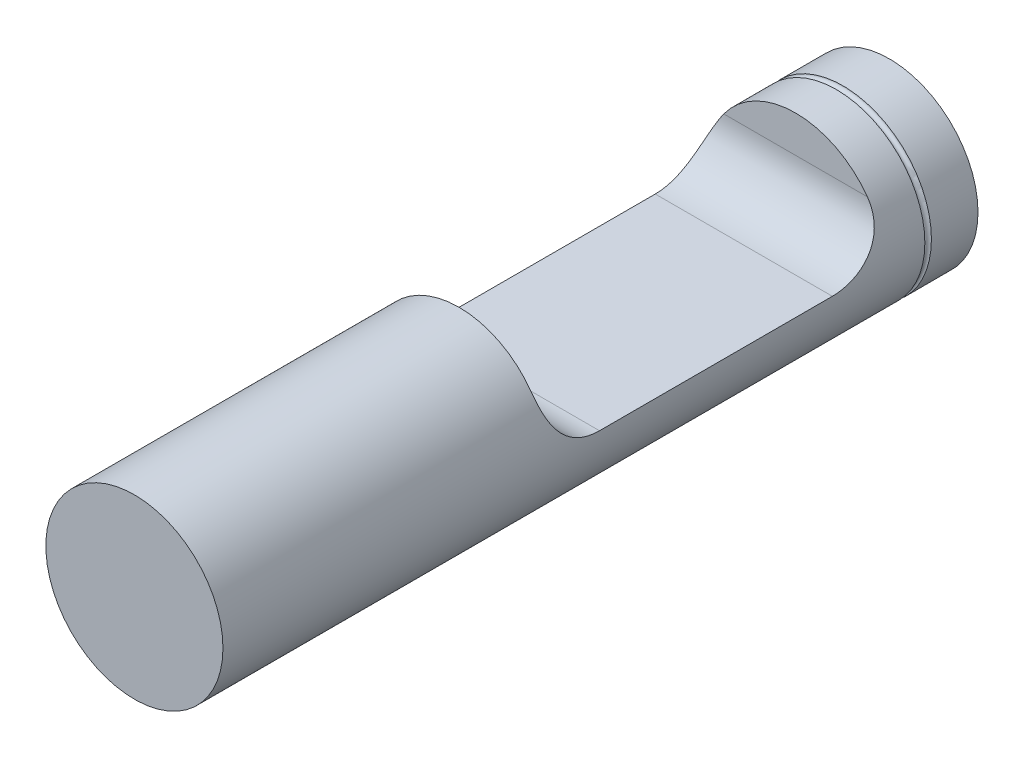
ISO-10303-21;
HEADER;
FILE_DESCRIPTION(('STEP AP214'),'2;1');
FILE_NAME('part.step','',(''),(''),'','','');
FILE_SCHEMA(('AUTOMOTIVE_DESIGN { 1 0 10303 214 1 1 1 1 }'));
ENDSEC;
DATA;
#1=APPLICATION_CONTEXT('core data for automotive mechanical design processes');
#2=APPLICATION_PROTOCOL_DEFINITION('international standard','automotive_design',2000,#1);
#3=PRODUCT_CONTEXT('',#1,'mechanical');
#4=PRODUCT('Part','Part','',(#3));
#5=PRODUCT_RELATED_PRODUCT_CATEGORY('part','',(#4));
#6=PRODUCT_DEFINITION_FORMATION('','',#4);
#7=PRODUCT_DEFINITION_CONTEXT('part definition',#1,'design');
#8=PRODUCT_DEFINITION('design','',#6,#7);
#9=PRODUCT_DEFINITION_SHAPE('','',#8);
#10=(LENGTH_UNIT() NAMED_UNIT(*) SI_UNIT(.MILLI.,.METRE.));
#11=(NAMED_UNIT(*) PLANE_ANGLE_UNIT() SI_UNIT($,.RADIAN.));
#12=(NAMED_UNIT(*) SI_UNIT($,.STERADIAN.) SOLID_ANGLE_UNIT());
#13=UNCERTAINTY_MEASURE_WITH_UNIT(LENGTH_MEASURE(1.E-05),#10,'distance_accuracy_value','');
#14=(GEOMETRIC_REPRESENTATION_CONTEXT(3) GLOBAL_UNCERTAINTY_ASSIGNED_CONTEXT((#13)) GLOBAL_UNIT_ASSIGNED_CONTEXT((#10,
#11,#12)) REPRESENTATION_CONTEXT('',''));
#15=CARTESIAN_POINT('',(0.,0.,0.));
#16=DIRECTION('',(0.,0.,1.));
#17=DIRECTION('',(1.,0.,0.));
#18=AXIS2_PLACEMENT_3D('',#15,#16,#17);
#19=CARTESIAN_POINT('',(0.,0.,-11.51));
#20=DIRECTION('',(0.,0.,1.));
#21=DIRECTION('',(1.,0.,0.));
#22=AXIS2_PLACEMENT_3D('',#19,#20,#21);
#23=CYLINDRICAL_SURFACE('',#22,1.35);
#24=CARTESIAN_POINT('',(0.,0.,-4.95));
#25=DIRECTION('',(0.,0.,-1.));
#26=DIRECTION('',(-1.,0.,0.));
#27=AXIS2_PLACEMENT_3D('',#24,#25,#26);
#28=CIRCLE('',#27,1.35);
#29=CARTESIAN_POINT('',(-1.09471457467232,0.79,-4.95));
#30=VERTEX_POINT('',#29);
#31=CARTESIAN_POINT('',(1.09471457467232,0.79,-4.95));
#32=VERTEX_POINT('',#31);
#33=EDGE_CURVE('E104',#30,#32,#28,.T.);
#34=ORIENTED_EDGE('',*,*,#33,.F.);
#35=CARTESIAN_POINT('',(-1.09471457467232,0.79,-4.95));
#36=CARTESIAN_POINT('',(-1.10753067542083,0.772242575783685,-4.95000059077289));
#37=CARTESIAN_POINT('',(-1.11990981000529,0.754174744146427,-4.95059953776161));
#38=CARTESIAN_POINT('',(-1.14374632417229,0.71751167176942,-4.95311743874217));
#39=CARTESIAN_POINT('',(-1.15520298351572,0.698916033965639,-4.95503741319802));
#40=CARTESIAN_POINT('',(-1.18811575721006,0.642473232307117,-4.96296940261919));
#41=CARTESIAN_POINT('',(-1.2080825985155,0.604014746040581,-4.97115409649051));
#42=CARTESIAN_POINT('',(-1.24371033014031,0.526786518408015,-4.99404541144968));
#43=CARTESIAN_POINT('',(-1.25934948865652,0.488016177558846,-5.00878401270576));
#44=CARTESIAN_POINT('',(-1.28616882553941,0.412170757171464,-5.04494314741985));
#45=CARTESIAN_POINT('',(-1.29735817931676,0.375092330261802,-5.06634976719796));
#46=CARTESIAN_POINT('',(-1.31505660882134,0.307033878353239,-5.11356050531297));
#47=CARTESIAN_POINT('',(-1.32186040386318,0.275804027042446,-5.13889732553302));
#48=CARTESIAN_POINT('',(-1.33272700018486,0.217314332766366,-5.19432967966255));
#49=CARTESIAN_POINT('',(-1.33678772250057,0.190057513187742,-5.22442880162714));
#50=CARTESIAN_POINT('',(-1.34295906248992,0.140029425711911,-5.28907353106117));
#51=CARTESIAN_POINT('',(-1.34503853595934,0.117334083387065,-5.32368072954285));
#52=CARTESIAN_POINT('',(-1.3479148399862,0.077607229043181,-5.39604798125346));
#53=CARTESIAN_POINT('',(-1.34871135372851,0.0605771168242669,-5.43380881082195));
#54=CARTESIAN_POINT('',(-1.34972781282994,0.0312310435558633,-5.51543588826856));
#55=CARTESIAN_POINT('',(-1.34988252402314,0.0195525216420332,-5.55953582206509));
#56=CARTESIAN_POINT('',(-1.34998211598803,0.00783927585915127,-5.62666754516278));
#57=CARTESIAN_POINT('',(-1.34999318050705,0.00490226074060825,-5.64923074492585));
#58=CARTESIAN_POINT('',(-1.35000040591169,0.000982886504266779,-5.69452524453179));
#59=CARTESIAN_POINT('',(-1.34999656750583,4.34465088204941E-07,-5.71725653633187));
#60=CARTESIAN_POINT('',(-1.35,0.,-5.74));
#61=B_SPLINE_CURVE_WITH_KNOTS('',3,(#35,#36,#37,#38,#39,#40,#41,#42,#43,#44,#45,#46,#47,#48,#49,
#50,#51,#52,#53,#54,#55,#56,#57,#58,#59,#60),.UNSPECIFIED.,.F.,.F.,(4,2,2,2,2,2,2,2,2,2,2,2,4),
(0.,0.065671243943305,0.131393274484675,0.263000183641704,0.395256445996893,0.527238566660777,
0.649027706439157,0.770909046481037,0.894676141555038,1.01847379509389,1.15458593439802,
1.222774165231,1.29095915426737),.UNSPECIFIED.);
#62=CARTESIAN_POINT('',(-1.35,0.,-5.74));
#63=VERTEX_POINT('',#62);
#64=EDGE_CURVE('E11',#30,#63,#61,.T.);
#65=ORIENTED_EDGE('',*,*,#64,.T.);
#66=DIRECTION('',(0.,0.,1.));
#67=VECTOR('',#66,1.);
#68=CARTESIAN_POINT('',(-1.35,0.,-11.51));
#69=LINE('',#68,#67);
#70=CARTESIAN_POINT('',(-1.35,0.,-9.29));
#71=VERTEX_POINT('',#70);
#72=EDGE_CURVE('E92',#71,#63,#69,.T.);
#73=ORIENTED_EDGE('',*,*,#72,.F.);
#74=CARTESIAN_POINT('',(-1.35,0.,-9.29));
#75=CARTESIAN_POINT('',(-1.34999688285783,1.57990570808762E-07,-9.31215081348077));
#76=CARTESIAN_POINT('',(-1.35000035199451,0.000932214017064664,-9.33429103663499));
#77=CARTESIAN_POINT('',(-1.34999387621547,0.00465066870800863,-9.37841442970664));
#78=CARTESIAN_POINT('',(-1.34998393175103,0.00743700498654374,-9.40039760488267));
#79=CARTESIAN_POINT('',(-1.34989416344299,0.0185557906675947,-9.46586549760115));
#80=CARTESIAN_POINT('',(-1.34975450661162,0.0296480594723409,-9.50891427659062));
#81=CARTESIAN_POINT('',(-1.34879362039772,0.0588844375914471,-9.59254971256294));
#82=CARTESIAN_POINT('',(-1.34797193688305,0.0770332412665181,-9.63313470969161));
#83=CARTESIAN_POINT('',(-1.34484045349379,0.119845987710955,-9.71065644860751));
#84=CARTESIAN_POINT('',(-1.34253089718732,0.144508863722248,-9.74759378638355));
#85=CARTESIAN_POINT('',(-1.33550886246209,0.199152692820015,-9.81620885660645));
#86=CARTESIAN_POINT('',(-1.33083031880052,0.229054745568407,-9.84795271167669));
#87=CARTESIAN_POINT('',(-1.3181688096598,0.293251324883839,-9.90579494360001));
#88=CARTESIAN_POINT('',(-1.31018959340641,0.327540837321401,-9.93189967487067));
#89=CARTESIAN_POINT('',(-1.29075735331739,0.397082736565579,-9.97653417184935));
#90=CARTESIAN_POINT('',(-1.27951885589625,0.432179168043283,-9.9954008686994));
#91=CARTESIAN_POINT('',(-1.25313278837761,0.503596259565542,-10.0272961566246));
#92=CARTESIAN_POINT('',(-1.23797916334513,0.539918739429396,-10.0403156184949));
#93=CARTESIAN_POINT('',(-1.20356311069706,0.612848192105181,-10.0608261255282));
#94=CARTESIAN_POINT('',(-1.1842449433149,0.649451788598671,-10.0682353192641));
#95=CARTESIAN_POINT('',(-1.15258684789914,0.703191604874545,-10.075424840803));
#96=CARTESIAN_POINT('',(-1.14159448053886,0.720900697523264,-10.0771674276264));
#97=CARTESIAN_POINT('',(-1.11877173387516,0.755833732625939,-10.0794543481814));
#98=CARTESIAN_POINT('',(-1.10694193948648,0.773058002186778,-10.0799995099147));
#99=CARTESIAN_POINT('',(-1.09471457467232,0.79,-10.08));
#100=B_SPLINE_CURVE_WITH_KNOTS('',3,(#74,#75,#76,#77,#78,#79,#80,#81,#82,#83,#84,#85,#86,#87,
#88,#89,#90,#91,#92,#93,#94,#95,#96,#97,#98,#99),.UNSPECIFIED.,.F.,.F.,(4,2,2,2,2,2,2,2,2,2,2,2,
4),(0.,0.0664117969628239,0.132821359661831,0.265505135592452,0.398277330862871,
0.531027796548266,0.661928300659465,0.792680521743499,0.916261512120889,1.04003478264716,
1.16558079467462,1.22828123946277,1.29093831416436),.UNSPECIFIED.);
#101=CARTESIAN_POINT('',(-1.09471457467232,0.79,-10.08));
#102=VERTEX_POINT('',#101);
#103=EDGE_CURVE('E76',#71,#102,#100,.T.);
#104=ORIENTED_EDGE('',*,*,#103,.T.);
#105=CARTESIAN_POINT('',(0.,0.,-10.08));
#106=DIRECTION('',(0.,0.,1.));
#107=DIRECTION('',(1.,0.,0.));
#108=AXIS2_PLACEMENT_3D('',#105,#106,#107);
#109=CIRCLE('',#108,1.35);
#110=CARTESIAN_POINT('',(1.09471457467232,0.79,-10.08));
#111=VERTEX_POINT('',#110);
#112=EDGE_CURVE('E146',#111,#102,#109,.T.);
#113=ORIENTED_EDGE('',*,*,#112,.F.);
#114=CARTESIAN_POINT('',(1.09471457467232,0.79,-10.08));
#115=CARTESIAN_POINT('',(1.10753067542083,0.772242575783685,-10.0799994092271));
#116=CARTESIAN_POINT('',(1.11990981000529,0.754174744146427,-10.0794004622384));
#117=CARTESIAN_POINT('',(1.14374632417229,0.71751167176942,-10.0768825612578));
#118=CARTESIAN_POINT('',(1.15520298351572,0.698916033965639,-10.074962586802));
#119=CARTESIAN_POINT('',(1.18811575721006,0.642473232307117,-10.0670305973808));
#120=CARTESIAN_POINT('',(1.2080825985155,0.604014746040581,-10.0588459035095));
#121=CARTESIAN_POINT('',(1.24371033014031,0.526786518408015,-10.0359545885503));
#122=CARTESIAN_POINT('',(1.25934948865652,0.488016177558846,-10.0212159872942));
#123=CARTESIAN_POINT('',(1.28616882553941,0.412170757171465,-9.98505685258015));
#124=CARTESIAN_POINT('',(1.29735817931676,0.375092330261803,-9.96365023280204));
#125=CARTESIAN_POINT('',(1.31505660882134,0.30703387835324,-9.91643949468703));
#126=CARTESIAN_POINT('',(1.32186040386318,0.275804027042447,-9.89110267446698));
#127=CARTESIAN_POINT('',(1.33272700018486,0.217314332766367,-9.83567032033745));
#128=CARTESIAN_POINT('',(1.33678772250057,0.190057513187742,-9.80557119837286));
#129=CARTESIAN_POINT('',(1.34295906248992,0.140029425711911,-9.74092646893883));
#130=CARTESIAN_POINT('',(1.34503853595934,0.117334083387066,-9.70631927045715));
#131=CARTESIAN_POINT('',(1.3479148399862,0.0776072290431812,-9.63395201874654));
#132=CARTESIAN_POINT('',(1.34871135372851,0.0605771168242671,-9.59619118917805));
#133=CARTESIAN_POINT('',(1.34972781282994,0.0312310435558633,-9.51456411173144));
#134=CARTESIAN_POINT('',(1.34988252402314,0.0195525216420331,-9.47046417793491));
#135=CARTESIAN_POINT('',(1.34998211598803,0.00783927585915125,-9.40333245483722));
#136=CARTESIAN_POINT('',(1.34999318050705,0.00490226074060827,-9.38076925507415));
#137=CARTESIAN_POINT('',(1.35000040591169,0.00098288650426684,-9.33547475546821));
#138=CARTESIAN_POINT('',(1.34999656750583,4.34465088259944E-07,-9.31274346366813));
#139=CARTESIAN_POINT('',(1.35,0.,-9.29));
#140=B_SPLINE_CURVE_WITH_KNOTS('',3,(#114,#115,#116,#117,#118,#119,#120,#121,#122,#123,#124,
#125,#126,#127,#128,#129,#130,#131,#132,#133,#134,#135,#136,#137,#138,#139),.UNSPECIFIED.,.F.,
.F.,(4,2,2,2,2,2,2,2,2,2,2,2,4),(0.,0.0656712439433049,0.131393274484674,0.263000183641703,
0.395256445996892,0.527238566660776,0.649027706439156,0.770909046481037,0.894676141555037,
1.01847379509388,1.15458593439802,1.222774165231,1.29095915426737),.UNSPECIFIED.);
#141=CARTESIAN_POINT('',(1.35,0.,-9.29));
#142=VERTEX_POINT('',#141);
#143=EDGE_CURVE('E85',#111,#142,#140,.T.);
#144=ORIENTED_EDGE('',*,*,#143,.T.);
#145=DIRECTION('',(0.,0.,1.));
#146=VECTOR('',#145,1.);
#147=CARTESIAN_POINT('',(1.35,0.,-11.51));
#148=LINE('',#147,#146);
#149=CARTESIAN_POINT('',(1.35,0.,-5.74));
#150=VERTEX_POINT('',#149);
#151=EDGE_CURVE('E94',#150,#142,#148,.F.);
#152=ORIENTED_EDGE('',*,*,#151,.F.);
#153=CARTESIAN_POINT('',(1.35,0.,-5.74));
#154=CARTESIAN_POINT('',(1.34999688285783,1.57990570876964E-07,-5.71784918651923));
#155=CARTESIAN_POINT('',(1.35000035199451,0.000932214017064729,-5.69570896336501));
#156=CARTESIAN_POINT('',(1.34999387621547,0.00465066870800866,-5.65158557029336));
#157=CARTESIAN_POINT('',(1.34998393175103,0.00743700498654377,-5.62960239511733));
#158=CARTESIAN_POINT('',(1.34989416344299,0.0185557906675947,-5.56413450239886));
#159=CARTESIAN_POINT('',(1.34975450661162,0.0296480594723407,-5.52108572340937));
#160=CARTESIAN_POINT('',(1.34879362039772,0.0588844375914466,-5.43745028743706));
#161=CARTESIAN_POINT('',(1.34797193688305,0.0770332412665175,-5.39686529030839));
#162=CARTESIAN_POINT('',(1.34484045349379,0.119845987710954,-5.3193435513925));
#163=CARTESIAN_POINT('',(1.34253089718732,0.144508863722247,-5.28240621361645));
#164=CARTESIAN_POINT('',(1.33550886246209,0.199152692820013,-5.21379114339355));
#165=CARTESIAN_POINT('',(1.33083031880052,0.229054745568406,-5.18204728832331));
#166=CARTESIAN_POINT('',(1.3181688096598,0.293251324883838,-5.12420505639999));
#167=CARTESIAN_POINT('',(1.31018959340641,0.3275408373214,-5.09810032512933));
#168=CARTESIAN_POINT('',(1.29075735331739,0.397082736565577,-5.05346582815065));
#169=CARTESIAN_POINT('',(1.27951885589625,0.432179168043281,-5.0345991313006));
#170=CARTESIAN_POINT('',(1.25313278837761,0.50359625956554,-5.00270384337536));
#171=CARTESIAN_POINT('',(1.23797916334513,0.539918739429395,-4.98968438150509));
#172=CARTESIAN_POINT('',(1.20356311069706,0.61284819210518,-4.96917387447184));
#173=CARTESIAN_POINT('',(1.1842449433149,0.649451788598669,-4.96176468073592));
#174=CARTESIAN_POINT('',(1.15258684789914,0.703191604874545,-4.95457515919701));
#175=CARTESIAN_POINT('',(1.14159448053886,0.720900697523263,-4.95283257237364));
#176=CARTESIAN_POINT('',(1.11877173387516,0.755833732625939,-4.95054565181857));
#177=CARTESIAN_POINT('',(1.10694193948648,0.773058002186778,-4.95000049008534));
#178=CARTESIAN_POINT('',(1.09471457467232,0.79,-4.95));
#179=B_SPLINE_CURVE_WITH_KNOTS('',3,(#153,#154,#155,#156,#157,#158,#159,#160,#161,#162,#163,
#164,#165,#166,#167,#168,#169,#170,#171,#172,#173,#174,#175,#176,#177,#178),.UNSPECIFIED.,.F.,
.F.,(4,2,2,2,2,2,2,2,2,2,2,2,4),(0.,0.0664117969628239,0.132821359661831,0.265505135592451,
0.398277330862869,0.531027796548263,0.661928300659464,0.792680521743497,0.916261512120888,
1.04003478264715,1.16558079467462,1.22828123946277,1.29093831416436),.UNSPECIFIED.);
#180=EDGE_CURVE('E44',#150,#32,#179,.T.);
#181=ORIENTED_EDGE('',*,*,#180,.T.);
#182=EDGE_LOOP('',(#34,#65,#73,#104,#113,#144,#152,#181));
#183=FACE_BOUND('',#182,.T.);
#184=CARTESIAN_POINT('',(0.,0.,0.));
#185=DIRECTION('',(0.,0.,1.));
#186=DIRECTION('',(1.,0.,0.));
#187=AXIS2_PLACEMENT_3D('',#184,#185,#186);
#188=CIRCLE('',#187,1.35);
#189=CARTESIAN_POINT('',(1.35,0.,0.));
#190=VERTEX_POINT('',#189);
#191=EDGE_CURVE('E99',#190,#190,#188,.T.);
#192=ORIENTED_EDGE('',*,*,#191,.F.);
#193=EDGE_LOOP('',(#192));
#194=FACE_BOUND('',#193,.T.);
#195=CARTESIAN_POINT('',(0.,0.,-10.7));
#196=DIRECTION('',(0.,0.,-1.));
#197=DIRECTION('',(0.,1.,0.));
#198=AXIS2_PLACEMENT_3D('',#195,#196,#197);
#199=CIRCLE('',#198,1.35);
#200=CARTESIAN_POINT('',(0.,1.35,-10.7));
#201=VERTEX_POINT('',#200);
#202=EDGE_CURVE('E39',#201,#201,#199,.F.);
#203=ORIENTED_EDGE('',*,*,#202,.T.);
#204=EDGE_LOOP('',(#203));
#205=FACE_BOUND('',#204,.T.);
#206=ADVANCED_FACE('F34',(#183,#194,#205),#23,.T.);
#207=CARTESIAN_POINT('',(0.,0.,0.));
#208=DIRECTION('',(0.,0.,1.));
#209=DIRECTION('',(1.,0.,0.));
#210=AXIS2_PLACEMENT_3D('',#207,#208,#209);
#211=PLANE('',#210);
#212=ORIENTED_EDGE('',*,*,#191,.T.);
#213=EDGE_LOOP('',(#212));
#214=FACE_BOUND('',#213,.T.);
#215=ADVANCED_FACE('F127',(#214),#211,.T.);
#216=CARTESIAN_POINT('',(-1.9,1.351,-4.95));
#217=DIRECTION('',(0.,0.,-1.));
#218=DIRECTION('',(-1.,0.,0.));
#219=AXIS2_PLACEMENT_3D('',#216,#217,#218);
#220=PLANE('',#219);
#221=ORIENTED_EDGE('',*,*,#33,.T.);
#222=DIRECTION('',(1.,0.,0.));
#223=VECTOR('',#222,1.);
#224=CARTESIAN_POINT('',(-1.35,0.79,-4.95));
#225=LINE('',#224,#223);
#226=EDGE_CURVE('E57',#32,#30,#225,.F.);
#227=ORIENTED_EDGE('',*,*,#226,.T.);
#228=EDGE_LOOP('',(#221,#227));
#229=FACE_BOUND('',#228,.T.);
#230=ADVANCED_FACE('F151',(#229),#220,.T.);
#231=CARTESIAN_POINT('',(-1.9,1.351,-10.08));
#232=DIRECTION('',(0.,0.,1.));
#233=DIRECTION('',(1.,0.,0.));
#234=AXIS2_PLACEMENT_3D('',#231,#232,#233);
#235=PLANE('',#234);
#236=ORIENTED_EDGE('',*,*,#112,.T.);
#237=DIRECTION('',(-1.,0.,0.));
#238=VECTOR('',#237,1.);
#239=CARTESIAN_POINT('',(1.35,0.79,-10.08));
#240=LINE('',#239,#238);
#241=EDGE_CURVE('E81',#102,#111,#240,.F.);
#242=ORIENTED_EDGE('',*,*,#241,.T.);
#243=EDGE_LOOP('',(#236,#242));
#244=FACE_BOUND('',#243,.T.);
#245=ADVANCED_FACE('F165',(#244),#235,.T.);
#246=CARTESIAN_POINT('',(-1.9,0.,-4.95));
#247=DIRECTION('',(0.,1.,0.));
#248=DIRECTION('',(0.,0.,1.));
#249=AXIS2_PLACEMENT_3D('',#246,#247,#248);
#250=PLANE('',#249);
#251=ORIENTED_EDGE('',*,*,#151,.T.);
#252=DIRECTION('',(-1.,0.,0.));
#253=VECTOR('',#252,1.);
#254=CARTESIAN_POINT('',(-1.35,0.,-9.29));
#255=LINE('',#254,#253);
#256=EDGE_CURVE('E80',#142,#71,#255,.T.);
#257=ORIENTED_EDGE('',*,*,#256,.T.);
#258=ORIENTED_EDGE('',*,*,#72,.T.);
#259=DIRECTION('',(1.,0.,0.));
#260=VECTOR('',#259,1.);
#261=CARTESIAN_POINT('',(1.35,0.,-5.74));
#262=LINE('',#261,#260);
#263=EDGE_CURVE('E95',#63,#150,#262,.T.);
#264=ORIENTED_EDGE('',*,*,#263,.T.);
#265=EDGE_LOOP('',(#251,#257,#258,#264));
#266=FACE_BOUND('',#265,.T.);
#267=ADVANCED_FACE('F90',(#266),#250,.T.);
#268=CARTESIAN_POINT('',(-1.9,0.79,-9.29));
#269=DIRECTION('',(1.,0.,0.));
#270=DIRECTION('',(0.,0.,-1.));
#271=AXIS2_PLACEMENT_3D('',#268,#269,#270);
#272=CYLINDRICAL_SURFACE('',#271,0.79);
#273=ORIENTED_EDGE('',*,*,#143,.F.);
#274=ORIENTED_EDGE('',*,*,#241,.F.);
#275=ORIENTED_EDGE('',*,*,#103,.F.);
#276=ORIENTED_EDGE('',*,*,#256,.F.);
#277=EDGE_LOOP('',(#273,#274,#275,#276));
#278=FACE_BOUND('',#277,.T.);
#279=ADVANCED_FACE('F79',(#278),#272,.F.);
#280=CARTESIAN_POINT('',(-1.9,0.79,-5.74));
#281=DIRECTION('',(-1.,0.,0.));
#282=DIRECTION('',(0.,0.,1.));
#283=AXIS2_PLACEMENT_3D('',#280,#281,#282);
#284=CYLINDRICAL_SURFACE('',#283,0.79);
#285=ORIENTED_EDGE('',*,*,#64,.F.);
#286=ORIENTED_EDGE('',*,*,#226,.F.);
#287=ORIENTED_EDGE('',*,*,#180,.F.);
#288=ORIENTED_EDGE('',*,*,#263,.F.);
#289=EDGE_LOOP('',(#285,#286,#287,#288));
#290=FACE_BOUND('',#289,.T.);
#291=ADVANCED_FACE('F36',(#290),#284,.F.);
#292=CARTESIAN_POINT('',(0.,0.,-10.75));
#293=DIRECTION('',(0.,0.,1.));
#294=DIRECTION('',(0.,-1.,0.));
#295=AXIS2_PLACEMENT_3D('',#292,#293,#294);
#296=TOROIDAL_SURFACE('',#295,1.35,0.0499999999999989);
#297=ORIENTED_EDGE('',*,*,#202,.F.);
#298=EDGE_LOOP('',(#297));
#299=FACE_BOUND('',#298,.T.);
#300=CARTESIAN_POINT('',(0.,0.,-10.8));
#301=DIRECTION('',(0.,0.,1.));
#302=DIRECTION('',(0.,-1.,0.));
#303=AXIS2_PLACEMENT_3D('',#300,#301,#302);
#304=CIRCLE('',#303,1.35);
#305=CARTESIAN_POINT('',(0.,-1.35,-10.8));
#306=VERTEX_POINT('',#305);
#307=EDGE_CURVE('E141',#306,#306,#304,.F.);
#308=ORIENTED_EDGE('',*,*,#307,.F.);
#309=EDGE_LOOP('',(#308));
#310=FACE_BOUND('',#309,.T.);
#311=ADVANCED_FACE('F154',(#299,#310),#296,.F.);
#312=CARTESIAN_POINT('',(0.,0.,-11.51));
#313=DIRECTION('',(0.,0.,1.));
#314=DIRECTION('',(1.,0.,0.));
#315=AXIS2_PLACEMENT_3D('',#312,#313,#314);
#316=PLANE('',#315);
#317=CARTESIAN_POINT('',(0.,0.,-11.51));
#318=DIRECTION('',(0.,0.,1.));
#319=DIRECTION('',(1.,0.,0.));
#320=AXIS2_PLACEMENT_3D('',#317,#318,#319);
#321=CIRCLE('',#320,1.35);
#322=CARTESIAN_POINT('',(1.35,0.,-11.51));
#323=VERTEX_POINT('',#322);
#324=EDGE_CURVE('E102',#323,#323,#321,.T.);
#325=ORIENTED_EDGE('',*,*,#324,.F.);
#326=EDGE_LOOP('',(#325));
#327=FACE_BOUND('',#326,.T.);
#328=ADVANCED_FACE('F159',(#327),#316,.F.);
#329=ORIENTED_EDGE('',*,*,#324,.T.);
#330=EDGE_LOOP('',(#329));
#331=FACE_BOUND('',#330,.T.);
#332=ORIENTED_EDGE('',*,*,#307,.T.);
#333=EDGE_LOOP('',(#332));
#334=FACE_BOUND('',#333,.T.);
#335=ADVANCED_FACE('F128',(#331,#334),#23,.T.);
#336=CLOSED_SHELL('',(#206,#215,#230,#245,#267,#279,#291,#311,#328,#335));
#337=MANIFOLD_SOLID_BREP('B2',#336);
#338=ADVANCED_BREP_SHAPE_REPRESENTATION('',(#18,#337),#14);
#339=SHAPE_DEFINITION_REPRESENTATION(#9,#338);
ENDSEC;
END-ISO-10303-21;
